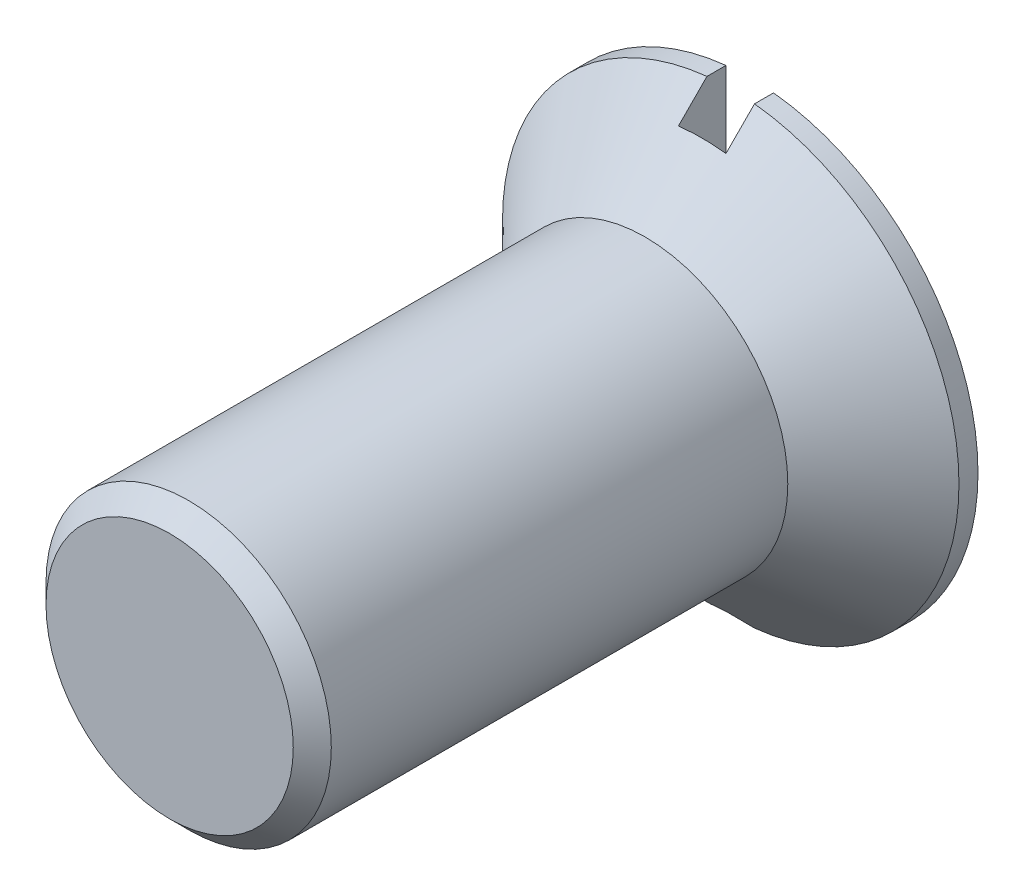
from build123d import *

# Parameters (mm, degrees)
SKETCH1_R      = 1.5
EXTRUDE1_DEPTH = 5
CHAMFER1_SIZE  = 0.2
SKETCH4_W      = 0.5
SKETCH4_H      = 6.200398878
EXTRUDE2_DEPTH = 0.5


with BuildPart() as part:
    # Sketch1 → Extrude1 (new body)
    with BuildSketch(Plane.XY):
        Circle(SKETCH1_R)
    extrude(amount=EXTRUDE1_DEPTH)

    # Chamfer1
    chamfer1_edges = [part.edges().sort_by_distance(p)[0] for p in [
        (-1.5, 0, 5),
    ]]
    chamfer(chamfer1_edges, length=CHAMFER1_SIZE)

    # Sketch3 → Revolve1 (revolve)
    with BuildSketch(Plane(origin=(0, 0, 0), x_dir=(1, 0, 0), z_dir=(0, 1, 0))):
        Polygon((-1.5, 0), (-2.4, 0.9), (-2.4, 1.1), (0, 1.1), (0, 0), align=None)
    revolve(axis=Axis((0, 0, 0), (0, 0, -1)))

    # Sketch4 → Extrude2 (cut)
    with BuildSketch(Plane(origin=(0, 0, -1.1), x_dir=(-1, 0, 0), z_dir=(0, 0, -1))):
        Rectangle(SKETCH4_W, SKETCH4_H)
    extrude(amount=-EXTRUDE2_DEPTH, mode=Mode.SUBTRACT)


solid = part.part
